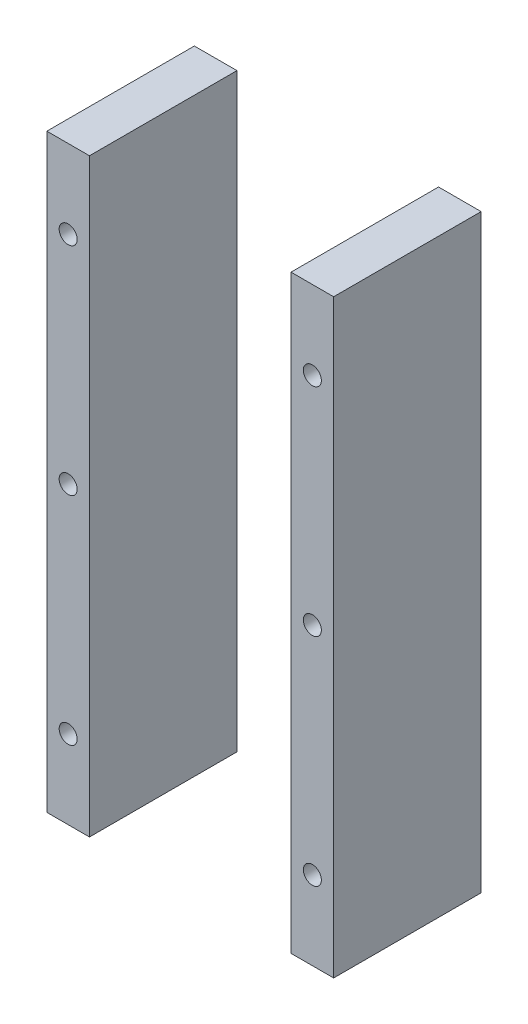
ISO-10303-21;
HEADER;
FILE_DESCRIPTION(('STEP AP214'),'2;1');
FILE_NAME('part.step','',(''),(''),'','','');
FILE_SCHEMA(('AUTOMOTIVE_DESIGN { 1 0 10303 214 1 1 1 1 }'));
ENDSEC;
DATA;
#1=APPLICATION_CONTEXT('core data for automotive mechanical design processes');
#2=APPLICATION_PROTOCOL_DEFINITION('international standard','automotive_design',2000,#1);
#3=PRODUCT_CONTEXT('',#1,'mechanical');
#4=PRODUCT('Part','Part','',(#3));
#5=PRODUCT_RELATED_PRODUCT_CATEGORY('part','',(#4));
#6=PRODUCT_DEFINITION_FORMATION('','',#4);
#7=PRODUCT_DEFINITION_CONTEXT('part definition',#1,'design');
#8=PRODUCT_DEFINITION('design','',#6,#7);
#9=PRODUCT_DEFINITION_SHAPE('','',#8);
#10=(LENGTH_UNIT() NAMED_UNIT(*) SI_UNIT(.MILLI.,.METRE.));
#11=(NAMED_UNIT(*) PLANE_ANGLE_UNIT() SI_UNIT($,.RADIAN.));
#12=(NAMED_UNIT(*) SI_UNIT($,.STERADIAN.) SOLID_ANGLE_UNIT());
#13=UNCERTAINTY_MEASURE_WITH_UNIT(LENGTH_MEASURE(1.E-05),#10,'distance_accuracy_value','');
#14=(GEOMETRIC_REPRESENTATION_CONTEXT(3) GLOBAL_UNCERTAINTY_ASSIGNED_CONTEXT((#13)) GLOBAL_UNIT_ASSIGNED_CONTEXT((#10,
#11,#12)) REPRESENTATION_CONTEXT('',''));
#15=CARTESIAN_POINT('',(0.,0.,0.));
#16=DIRECTION('',(0.,0.,1.));
#17=DIRECTION('',(1.,0.,0.));
#18=AXIS2_PLACEMENT_3D('',#15,#16,#17);
#19=CARTESIAN_POINT('',(136.,-180.,90.));
#20=DIRECTION('',(1.,0.,0.));
#21=DIRECTION('',(0.,0.,-1.));
#22=AXIS2_PLACEMENT_3D('',#19,#20,#21);
#23=PLANE('',#22);
#24=DIRECTION('',(0.,-1.,0.));
#25=VECTOR('',#24,1.);
#26=CARTESIAN_POINT('',(136.,-180.,0.));
#27=LINE('',#26,#25);
#28=CARTESIAN_POINT('',(136.,180.,0.));
#29=VERTEX_POINT('',#28);
#30=CARTESIAN_POINT('',(136.,-180.,0.));
#31=VERTEX_POINT('',#30);
#32=EDGE_CURVE('E106',#29,#31,#27,.T.);
#33=ORIENTED_EDGE('',*,*,#32,.T.);
#34=DIRECTION('',(0.,0.,-1.));
#35=VECTOR('',#34,1.);
#36=CARTESIAN_POINT('',(136.,-180.,90.));
#37=LINE('',#36,#35);
#38=CARTESIAN_POINT('',(136.,-180.,90.));
#39=VERTEX_POINT('',#38);
#40=EDGE_CURVE('E12',#39,#31,#37,.T.);
#41=ORIENTED_EDGE('',*,*,#40,.F.);
#42=DIRECTION('',(0.,-1.,0.));
#43=VECTOR('',#42,1.);
#44=CARTESIAN_POINT('',(136.,-180.,90.));
#45=LINE('',#44,#43);
#46=CARTESIAN_POINT('',(136.,180.,90.));
#47=VERTEX_POINT('',#46);
#48=EDGE_CURVE('E94',#47,#39,#45,.T.);
#49=ORIENTED_EDGE('',*,*,#48,.F.);
#50=DIRECTION('',(0.,0.,-1.));
#51=VECTOR('',#50,1.);
#52=CARTESIAN_POINT('',(136.,180.,90.));
#53=LINE('',#52,#51);
#54=EDGE_CURVE('E102',#47,#29,#53,.T.);
#55=ORIENTED_EDGE('',*,*,#54,.T.);
#56=EDGE_LOOP('',(#33,#41,#49,#55));
#57=FACE_BOUND('',#56,.T.);
#58=ADVANCED_FACE('F43',(#57),#23,.F.);
#59=CARTESIAN_POINT('',(162.,-180.,90.));
#60=DIRECTION('',(0.,1.,0.));
#61=DIRECTION('',(0.,0.,1.));
#62=AXIS2_PLACEMENT_3D('',#59,#60,#61);
#63=PLANE('',#62);
#64=DIRECTION('',(1.,0.,0.));
#65=VECTOR('',#64,1.);
#66=CARTESIAN_POINT('',(162.,-180.,0.));
#67=LINE('',#66,#65);
#68=CARTESIAN_POINT('',(162.,-180.,0.));
#69=VERTEX_POINT('',#68);
#70=EDGE_CURVE('E98',#31,#69,#67,.T.);
#71=ORIENTED_EDGE('',*,*,#70,.T.);
#72=DIRECTION('',(0.,0.,-1.));
#73=VECTOR('',#72,1.);
#74=CARTESIAN_POINT('',(162.,-180.,90.));
#75=LINE('',#74,#73);
#76=CARTESIAN_POINT('',(162.,-180.,90.));
#77=VERTEX_POINT('',#76);
#78=EDGE_CURVE('E51',#77,#69,#75,.T.);
#79=ORIENTED_EDGE('',*,*,#78,.F.);
#80=DIRECTION('',(1.,0.,0.));
#81=VECTOR('',#80,1.);
#82=CARTESIAN_POINT('',(162.,-180.,90.));
#83=LINE('',#82,#81);
#84=EDGE_CURVE('E89',#39,#77,#83,.T.);
#85=ORIENTED_EDGE('',*,*,#84,.F.);
#86=ORIENTED_EDGE('',*,*,#40,.T.);
#87=EDGE_LOOP('',(#71,#79,#85,#86));
#88=FACE_BOUND('',#87,.T.);
#89=ADVANCED_FACE('F97',(#88),#63,.F.);
#90=CARTESIAN_POINT('',(162.,180.,90.));
#91=DIRECTION('',(-1.,0.,0.));
#92=DIRECTION('',(0.,-1.,0.));
#93=AXIS2_PLACEMENT_3D('',#90,#91,#92);
#94=PLANE('',#93);
#95=DIRECTION('',(0.,1.,0.));
#96=VECTOR('',#95,1.);
#97=CARTESIAN_POINT('',(162.,180.,0.));
#98=LINE('',#97,#96);
#99=CARTESIAN_POINT('',(162.,180.,0.));
#100=VERTEX_POINT('',#99);
#101=EDGE_CURVE('E76',#69,#100,#98,.T.);
#102=ORIENTED_EDGE('',*,*,#101,.T.);
#103=DIRECTION('',(0.,0.,-1.));
#104=VECTOR('',#103,1.);
#105=CARTESIAN_POINT('',(162.,180.,90.));
#106=LINE('',#105,#104);
#107=CARTESIAN_POINT('',(162.,180.,90.));
#108=VERTEX_POINT('',#107);
#109=EDGE_CURVE('E99',#108,#100,#106,.T.);
#110=ORIENTED_EDGE('',*,*,#109,.F.);
#111=DIRECTION('',(0.,1.,0.));
#112=VECTOR('',#111,1.);
#113=CARTESIAN_POINT('',(162.,180.,90.));
#114=LINE('',#113,#112);
#115=EDGE_CURVE('E92',#77,#108,#114,.T.);
#116=ORIENTED_EDGE('',*,*,#115,.F.);
#117=ORIENTED_EDGE('',*,*,#78,.T.);
#118=EDGE_LOOP('',(#102,#110,#116,#117));
#119=FACE_BOUND('',#118,.T.);
#120=ADVANCED_FACE('F100',(#119),#94,.F.);
#121=CARTESIAN_POINT('',(136.,180.,90.));
#122=DIRECTION('',(0.,-1.,0.));
#123=DIRECTION('',(0.,0.,-1.));
#124=AXIS2_PLACEMENT_3D('',#121,#122,#123);
#125=PLANE('',#124);
#126=DIRECTION('',(-1.,0.,0.));
#127=VECTOR('',#126,1.);
#128=CARTESIAN_POINT('',(136.,180.,0.));
#129=LINE('',#128,#127);
#130=EDGE_CURVE('E82',#100,#29,#129,.T.);
#131=ORIENTED_EDGE('',*,*,#130,.T.);
#132=ORIENTED_EDGE('',*,*,#54,.F.);
#133=DIRECTION('',(-1.,0.,0.));
#134=VECTOR('',#133,1.);
#135=CARTESIAN_POINT('',(136.,180.,90.));
#136=LINE('',#135,#134);
#137=EDGE_CURVE('E59',#108,#47,#136,.T.);
#138=ORIENTED_EDGE('',*,*,#137,.F.);
#139=ORIENTED_EDGE('',*,*,#109,.T.);
#140=EDGE_LOOP('',(#131,#132,#138,#139));
#141=FACE_BOUND('',#140,.T.);
#142=ADVANCED_FACE('F114',(#141),#125,.F.);
#143=CARTESIAN_POINT('',(0.,0.,90.));
#144=DIRECTION('',(0.,0.,-1.));
#145=DIRECTION('',(-1.,0.,0.));
#146=AXIS2_PLACEMENT_3D('',#143,#144,#145);
#147=PLANE('',#146);
#148=CARTESIAN_POINT('',(149.,-132.,90.));
#149=DIRECTION('',(0.,0.,1.));
#150=DIRECTION('',(1.,0.,0.));
#151=AXIS2_PLACEMENT_3D('',#148,#149,#150);
#152=CIRCLE('',#151,5.49999999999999);
#153=CARTESIAN_POINT('',(154.5,-132.,90.));
#154=VERTEX_POINT('',#153);
#155=EDGE_CURVE('E132',#154,#154,#152,.T.);
#156=ORIENTED_EDGE('',*,*,#155,.F.);
#157=EDGE_LOOP('',(#156));
#158=FACE_BOUND('',#157,.T.);
#159=CARTESIAN_POINT('',(149.,1.11022302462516E-13,90.));
#160=DIRECTION('',(0.,0.,1.));
#161=DIRECTION('',(-1.,0.,0.));
#162=AXIS2_PLACEMENT_3D('',#159,#160,#161);
#163=CIRCLE('',#162,5.50000000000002);
#164=CARTESIAN_POINT('',(154.5,1.11022302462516E-13,90.));
#165=VERTEX_POINT('',#164);
#166=EDGE_CURVE('E126',#165,#165,#163,.T.);
#167=ORIENTED_EDGE('',*,*,#166,.F.);
#168=EDGE_LOOP('',(#167));
#169=FACE_BOUND('',#168,.T.);
#170=CARTESIAN_POINT('',(149.,132.,90.));
#171=DIRECTION('',(0.,0.,1.));
#172=DIRECTION('',(-1.,0.,0.));
#173=AXIS2_PLACEMENT_3D('',#170,#171,#172);
#174=CIRCLE('',#173,5.49999999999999);
#175=CARTESIAN_POINT('',(154.5,132.,90.));
#176=VERTEX_POINT('',#175);
#177=EDGE_CURVE('E120',#176,#176,#174,.T.);
#178=ORIENTED_EDGE('',*,*,#177,.F.);
#179=EDGE_LOOP('',(#178));
#180=FACE_BOUND('',#179,.T.);
#181=ORIENTED_EDGE('',*,*,#48,.T.);
#182=ORIENTED_EDGE('',*,*,#84,.T.);
#183=ORIENTED_EDGE('',*,*,#115,.T.);
#184=ORIENTED_EDGE('',*,*,#137,.T.);
#185=EDGE_LOOP('',(#181,#182,#183,#184));
#186=FACE_BOUND('',#185,.T.);
#187=ADVANCED_FACE('F90',(#158,#169,#180,#186),#147,.F.);
#188=CARTESIAN_POINT('',(0.,0.,0.));
#189=DIRECTION('',(0.,0.,-1.));
#190=DIRECTION('',(-1.,0.,0.));
#191=AXIS2_PLACEMENT_3D('',#188,#189,#190);
#192=PLANE('',#191);
#193=CARTESIAN_POINT('',(149.,-132.,0.));
#194=DIRECTION('',(0.,0.,1.));
#195=DIRECTION('',(1.,0.,0.));
#196=AXIS2_PLACEMENT_3D('',#193,#194,#195);
#197=CIRCLE('',#196,5.49999999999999);
#198=CARTESIAN_POINT('',(154.5,-132.,0.));
#199=VERTEX_POINT('',#198);
#200=EDGE_CURVE('E109',#199,#199,#197,.T.);
#201=ORIENTED_EDGE('',*,*,#200,.T.);
#202=EDGE_LOOP('',(#201));
#203=FACE_BOUND('',#202,.T.);
#204=CARTESIAN_POINT('',(149.,1.11022302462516E-13,0.));
#205=DIRECTION('',(0.,0.,1.));
#206=DIRECTION('',(-1.,0.,0.));
#207=AXIS2_PLACEMENT_3D('',#204,#205,#206);
#208=CIRCLE('',#207,5.50000000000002);
#209=CARTESIAN_POINT('',(154.5,1.11022302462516E-13,0.));
#210=VERTEX_POINT('',#209);
#211=EDGE_CURVE('E129',#210,#210,#208,.T.);
#212=ORIENTED_EDGE('',*,*,#211,.T.);
#213=EDGE_LOOP('',(#212));
#214=FACE_BOUND('',#213,.T.);
#215=CARTESIAN_POINT('',(149.,132.,0.));
#216=DIRECTION('',(0.,0.,1.));
#217=DIRECTION('',(-1.,0.,0.));
#218=AXIS2_PLACEMENT_3D('',#215,#216,#217);
#219=CIRCLE('',#218,5.49999999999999);
#220=CARTESIAN_POINT('',(154.5,132.,0.));
#221=VERTEX_POINT('',#220);
#222=EDGE_CURVE('E123',#221,#221,#219,.T.);
#223=ORIENTED_EDGE('',*,*,#222,.T.);
#224=EDGE_LOOP('',(#223));
#225=FACE_BOUND('',#224,.T.);
#226=ORIENTED_EDGE('',*,*,#32,.F.);
#227=ORIENTED_EDGE('',*,*,#130,.F.);
#228=ORIENTED_EDGE('',*,*,#101,.F.);
#229=ORIENTED_EDGE('',*,*,#70,.F.);
#230=EDGE_LOOP('',(#226,#227,#228,#229));
#231=FACE_BOUND('',#230,.T.);
#232=ADVANCED_FACE('F117',(#203,#214,#225,#231),#192,.T.);
#233=CARTESIAN_POINT('',(149.,132.,0.));
#234=DIRECTION('',(0.,0.,1.));
#235=DIRECTION('',(1.,0.,0.));
#236=AXIS2_PLACEMENT_3D('',#233,#234,#235);
#237=CYLINDRICAL_SURFACE('',#236,5.49999999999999);
#238=CARTESIAN_POINT('',(154.5,132.,0.));
#239=CARTESIAN_POINT('',(154.5,132.,0.937499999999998));
#240=CARTESIAN_POINT('',(154.5,132.,1.875));
#241=CARTESIAN_POINT('',(154.5,132.,3.75));
#242=CARTESIAN_POINT('',(154.5,132.,4.6875));
#243=CARTESIAN_POINT('',(154.5,132.,6.5625));
#244=CARTESIAN_POINT('',(154.5,132.,7.5));
#245=CARTESIAN_POINT('',(154.5,132.,9.375));
#246=CARTESIAN_POINT('',(154.5,132.,10.3125));
#247=CARTESIAN_POINT('',(154.5,132.,12.1875));
#248=CARTESIAN_POINT('',(154.5,132.,13.125));
#249=CARTESIAN_POINT('',(154.5,132.,15.));
#250=CARTESIAN_POINT('',(154.5,132.,15.9375));
#251=CARTESIAN_POINT('',(154.5,132.,17.8125));
#252=CARTESIAN_POINT('',(154.5,132.,18.75));
#253=CARTESIAN_POINT('',(154.5,132.,20.625));
#254=CARTESIAN_POINT('',(154.5,132.,21.5625));
#255=CARTESIAN_POINT('',(154.5,132.,23.4375));
#256=CARTESIAN_POINT('',(154.5,132.,24.375));
#257=CARTESIAN_POINT('',(154.5,132.,26.25));
#258=CARTESIAN_POINT('',(154.5,132.,27.1875));
#259=CARTESIAN_POINT('',(154.5,132.,29.0625));
#260=CARTESIAN_POINT('',(154.5,132.,30.));
#261=CARTESIAN_POINT('',(154.5,132.,31.875));
#262=CARTESIAN_POINT('',(154.5,132.,32.8125));
#263=CARTESIAN_POINT('',(154.5,132.,34.6875));
#264=CARTESIAN_POINT('',(154.5,132.,35.625));
#265=CARTESIAN_POINT('',(154.5,132.,37.5));
#266=CARTESIAN_POINT('',(154.5,132.,38.4375));
#267=CARTESIAN_POINT('',(154.5,132.,40.3125));
#268=CARTESIAN_POINT('',(154.5,132.,41.25));
#269=CARTESIAN_POINT('',(154.5,132.,43.125));
#270=CARTESIAN_POINT('',(154.5,132.,44.0625));
#271=CARTESIAN_POINT('',(154.5,132.,45.9375));
#272=CARTESIAN_POINT('',(154.5,132.,46.875));
#273=CARTESIAN_POINT('',(154.5,132.,48.75));
#274=CARTESIAN_POINT('',(154.5,132.,49.6875));
#275=CARTESIAN_POINT('',(154.5,132.,51.5625));
#276=CARTESIAN_POINT('',(154.5,132.,52.5));
#277=CARTESIAN_POINT('',(154.5,132.,54.375));
#278=CARTESIAN_POINT('',(154.5,132.,55.3125));
#279=CARTESIAN_POINT('',(154.5,132.,57.1875));
#280=CARTESIAN_POINT('',(154.5,132.,58.125));
#281=CARTESIAN_POINT('',(154.5,132.,60.));
#282=CARTESIAN_POINT('',(154.5,132.,60.9375));
#283=CARTESIAN_POINT('',(154.5,132.,62.8125));
#284=CARTESIAN_POINT('',(154.5,132.,63.75));
#285=CARTESIAN_POINT('',(154.5,132.,65.625));
#286=CARTESIAN_POINT('',(154.5,132.,66.5625));
#287=CARTESIAN_POINT('',(154.5,132.,68.4375));
#288=CARTESIAN_POINT('',(154.5,132.,69.375));
#289=CARTESIAN_POINT('',(154.5,132.,71.25));
#290=CARTESIAN_POINT('',(154.5,132.,72.1875));
#291=CARTESIAN_POINT('',(154.5,132.,74.0625));
#292=CARTESIAN_POINT('',(154.5,132.,75.));
#293=CARTESIAN_POINT('',(154.5,132.,76.875));
#294=CARTESIAN_POINT('',(154.5,132.,77.8125));
#295=CARTESIAN_POINT('',(154.5,132.,79.6875));
#296=CARTESIAN_POINT('',(154.5,132.,80.625));
#297=CARTESIAN_POINT('',(154.5,132.,82.5));
#298=CARTESIAN_POINT('',(154.5,132.,83.4375));
#299=CARTESIAN_POINT('',(154.5,132.,85.3125));
#300=CARTESIAN_POINT('',(154.5,132.,86.25));
#301=CARTESIAN_POINT('',(154.5,132.,88.125));
#302=CARTESIAN_POINT('',(154.5,132.,89.0625));
#303=CARTESIAN_POINT('',(154.5,132.,90.));
#304=B_SPLINE_CURVE_WITH_KNOTS('',3,(#238,#239,#240,#241,#242,#243,#244,#245,#246,#247,#248,
#249,#250,#251,#252,#253,#254,#255,#256,#257,#258,#259,#260,#261,#262,#263,#264,#265,#266,#267,
#268,#269,#270,#271,#272,#273,#274,#275,#276,#277,#278,#279,#280,#281,#282,#283,#284,#285,#286,
#287,#288,#289,#290,#291,#292,#293,#294,#295,#296,#297,#298,#299,#300,#301,#302,#303),
.UNSPECIFIED.,.F.,.F.,(4,2,2,2,2,2,2,2,2,2,2,2,2,2,2,2,2,2,2,2,2,2,2,2,2,2,2,2,2,2,2,2,4),(0.,
2.8125,5.625,8.4375,11.25,14.0625,16.875,19.6875,22.5,25.3125,28.125,30.9375,33.75,36.5625,
39.375,42.1875,45.,47.8125,50.625,53.4375,56.25,59.0625,61.875,64.6875,67.5,70.3125,73.125,
75.9375,78.75,81.5625,84.375,87.1875,90.),.UNSPECIFIED.);
#305=EDGE_CURVE('BSEAM154',#221,#176,#304,.T.);
#306=ORIENTED_EDGE('',*,*,#222,.F.);
#307=ORIENTED_EDGE('',*,*,#177,.T.);
#308=ORIENTED_EDGE('',*,*,#305,.T.);
#309=ORIENTED_EDGE('',*,*,#305,.F.);
#310=EDGE_LOOP('',(#306,#308,#307,#309));
#311=FACE_BOUND('',#310,.T.);
#312=ADVANCED_FACE('F154',(#311),#237,.F.);
#313=CARTESIAN_POINT('',(149.,1.11022302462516E-13,0.));
#314=DIRECTION('',(0.,0.,1.));
#315=DIRECTION('',(1.,0.,0.));
#316=AXIS2_PLACEMENT_3D('',#313,#314,#315);
#317=CYLINDRICAL_SURFACE('',#316,5.50000000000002);
#318=CARTESIAN_POINT('',(154.5,1.11022302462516E-13,0.));
#319=CARTESIAN_POINT('',(154.5,1.11022302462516E-13,0.937499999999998));
#320=CARTESIAN_POINT('',(154.5,1.11022302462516E-13,1.875));
#321=CARTESIAN_POINT('',(154.5,1.11022302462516E-13,3.75));
#322=CARTESIAN_POINT('',(154.5,1.11022302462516E-13,4.6875));
#323=CARTESIAN_POINT('',(154.5,1.11022302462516E-13,6.5625));
#324=CARTESIAN_POINT('',(154.5,1.11022302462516E-13,7.5));
#325=CARTESIAN_POINT('',(154.5,1.11022302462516E-13,9.375));
#326=CARTESIAN_POINT('',(154.5,1.11022302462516E-13,10.3125));
#327=CARTESIAN_POINT('',(154.5,1.11022302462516E-13,12.1875));
#328=CARTESIAN_POINT('',(154.5,1.11022302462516E-13,13.125));
#329=CARTESIAN_POINT('',(154.5,1.11022302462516E-13,15.));
#330=CARTESIAN_POINT('',(154.5,1.11022302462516E-13,15.9375));
#331=CARTESIAN_POINT('',(154.5,1.11022302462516E-13,17.8125));
#332=CARTESIAN_POINT('',(154.5,1.11022302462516E-13,18.75));
#333=CARTESIAN_POINT('',(154.5,1.11022302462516E-13,20.625));
#334=CARTESIAN_POINT('',(154.5,1.11022302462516E-13,21.5625));
#335=CARTESIAN_POINT('',(154.5,1.11022302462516E-13,23.4375));
#336=CARTESIAN_POINT('',(154.5,1.11022302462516E-13,24.375));
#337=CARTESIAN_POINT('',(154.5,1.11022302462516E-13,26.25));
#338=CARTESIAN_POINT('',(154.5,1.11022302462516E-13,27.1875));
#339=CARTESIAN_POINT('',(154.5,1.11022302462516E-13,29.0625));
#340=CARTESIAN_POINT('',(154.5,1.11022302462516E-13,30.));
#341=CARTESIAN_POINT('',(154.5,1.11022302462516E-13,31.875));
#342=CARTESIAN_POINT('',(154.5,1.11022302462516E-13,32.8125));
#343=CARTESIAN_POINT('',(154.5,1.11022302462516E-13,34.6875));
#344=CARTESIAN_POINT('',(154.5,1.11022302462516E-13,35.625));
#345=CARTESIAN_POINT('',(154.5,1.11022302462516E-13,37.5));
#346=CARTESIAN_POINT('',(154.5,1.11022302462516E-13,38.4375));
#347=CARTESIAN_POINT('',(154.5,1.11022302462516E-13,40.3125));
#348=CARTESIAN_POINT('',(154.5,1.11022302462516E-13,41.25));
#349=CARTESIAN_POINT('',(154.5,1.11022302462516E-13,43.125));
#350=CARTESIAN_POINT('',(154.5,1.11022302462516E-13,44.0625));
#351=CARTESIAN_POINT('',(154.5,1.11022302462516E-13,45.9375));
#352=CARTESIAN_POINT('',(154.5,1.11022302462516E-13,46.875));
#353=CARTESIAN_POINT('',(154.5,1.11022302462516E-13,48.75));
#354=CARTESIAN_POINT('',(154.5,1.11022302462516E-13,49.6875));
#355=CARTESIAN_POINT('',(154.5,1.11022302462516E-13,51.5625));
#356=CARTESIAN_POINT('',(154.5,1.11022302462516E-13,52.5));
#357=CARTESIAN_POINT('',(154.5,1.11022302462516E-13,54.375));
#358=CARTESIAN_POINT('',(154.5,1.11022302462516E-13,55.3125));
#359=CARTESIAN_POINT('',(154.5,1.11022302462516E-13,57.1875));
#360=CARTESIAN_POINT('',(154.5,1.11022302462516E-13,58.125));
#361=CARTESIAN_POINT('',(154.5,1.11022302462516E-13,60.));
#362=CARTESIAN_POINT('',(154.5,1.11022302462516E-13,60.9375));
#363=CARTESIAN_POINT('',(154.5,1.11022302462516E-13,62.8125));
#364=CARTESIAN_POINT('',(154.5,1.11022302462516E-13,63.75));
#365=CARTESIAN_POINT('',(154.5,1.11022302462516E-13,65.625));
#366=CARTESIAN_POINT('',(154.5,1.11022302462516E-13,66.5625));
#367=CARTESIAN_POINT('',(154.5,1.11022302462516E-13,68.4375));
#368=CARTESIAN_POINT('',(154.5,1.11022302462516E-13,69.375));
#369=CARTESIAN_POINT('',(154.5,1.11022302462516E-13,71.25));
#370=CARTESIAN_POINT('',(154.5,1.11022302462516E-13,72.1875));
#371=CARTESIAN_POINT('',(154.5,1.11022302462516E-13,74.0625));
#372=CARTESIAN_POINT('',(154.5,1.11022302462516E-13,75.));
#373=CARTESIAN_POINT('',(154.5,1.11022302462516E-13,76.875));
#374=CARTESIAN_POINT('',(154.5,1.11022302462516E-13,77.8125));
#375=CARTESIAN_POINT('',(154.5,1.11022302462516E-13,79.6875));
#376=CARTESIAN_POINT('',(154.5,1.11022302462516E-13,80.625));
#377=CARTESIAN_POINT('',(154.5,1.11022302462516E-13,82.5));
#378=CARTESIAN_POINT('',(154.5,1.11022302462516E-13,83.4375));
#379=CARTESIAN_POINT('',(154.5,1.11022302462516E-13,85.3125));
#380=CARTESIAN_POINT('',(154.5,1.11022302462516E-13,86.25));
#381=CARTESIAN_POINT('',(154.5,1.11022302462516E-13,88.125));
#382=CARTESIAN_POINT('',(154.5,1.11022302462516E-13,89.0625));
#383=CARTESIAN_POINT('',(154.5,1.11022302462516E-13,90.));
#384=B_SPLINE_CURVE_WITH_KNOTS('',3,(#318,#319,#320,#321,#322,#323,#324,#325,#326,#327,#328,
#329,#330,#331,#332,#333,#334,#335,#336,#337,#338,#339,#340,#341,#342,#343,#344,#345,#346,#347,
#348,#349,#350,#351,#352,#353,#354,#355,#356,#357,#358,#359,#360,#361,#362,#363,#364,#365,#366,
#367,#368,#369,#370,#371,#372,#373,#374,#375,#376,#377,#378,#379,#380,#381,#382,#383),
.UNSPECIFIED.,.F.,.F.,(4,2,2,2,2,2,2,2,2,2,2,2,2,2,2,2,2,2,2,2,2,2,2,2,2,2,2,2,2,2,2,2,4),(0.,
2.8125,5.625,8.4375,11.25,14.0625,16.875,19.6875,22.5,25.3125,28.125,30.9375,33.75,36.5625,
39.375,42.1875,45.,47.8125,50.625,53.4375,56.25,59.0625,61.875,64.6875,67.5,70.3125,73.125,
75.9375,78.75,81.5625,84.375,87.1875,90.),.UNSPECIFIED.);
#385=EDGE_CURVE('BSEAM143',#210,#165,#384,.T.);
#386=ORIENTED_EDGE('',*,*,#211,.F.);
#387=ORIENTED_EDGE('',*,*,#166,.T.);
#388=ORIENTED_EDGE('',*,*,#385,.T.);
#389=ORIENTED_EDGE('',*,*,#385,.F.);
#390=EDGE_LOOP('',(#386,#388,#387,#389));
#391=FACE_BOUND('',#390,.T.);
#392=ADVANCED_FACE('F143',(#391),#317,.F.);
#393=CARTESIAN_POINT('',(149.,-132.,0.));
#394=DIRECTION('',(0.,0.,1.));
#395=DIRECTION('',(1.,0.,0.));
#396=AXIS2_PLACEMENT_3D('',#393,#394,#395);
#397=CYLINDRICAL_SURFACE('',#396,5.49999999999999);
#398=CARTESIAN_POINT('',(154.5,-132.,0.));
#399=CARTESIAN_POINT('',(154.5,-132.,0.937499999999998));
#400=CARTESIAN_POINT('',(154.5,-132.,1.875));
#401=CARTESIAN_POINT('',(154.5,-132.,3.75));
#402=CARTESIAN_POINT('',(154.5,-132.,4.6875));
#403=CARTESIAN_POINT('',(154.5,-132.,6.5625));
#404=CARTESIAN_POINT('',(154.5,-132.,7.5));
#405=CARTESIAN_POINT('',(154.5,-132.,9.375));
#406=CARTESIAN_POINT('',(154.5,-132.,10.3125));
#407=CARTESIAN_POINT('',(154.5,-132.,12.1875));
#408=CARTESIAN_POINT('',(154.5,-132.,13.125));
#409=CARTESIAN_POINT('',(154.5,-132.,15.));
#410=CARTESIAN_POINT('',(154.5,-132.,15.9375));
#411=CARTESIAN_POINT('',(154.5,-132.,17.8125));
#412=CARTESIAN_POINT('',(154.5,-132.,18.75));
#413=CARTESIAN_POINT('',(154.5,-132.,20.625));
#414=CARTESIAN_POINT('',(154.5,-132.,21.5625));
#415=CARTESIAN_POINT('',(154.5,-132.,23.4375));
#416=CARTESIAN_POINT('',(154.5,-132.,24.375));
#417=CARTESIAN_POINT('',(154.5,-132.,26.25));
#418=CARTESIAN_POINT('',(154.5,-132.,27.1875));
#419=CARTESIAN_POINT('',(154.5,-132.,29.0625));
#420=CARTESIAN_POINT('',(154.5,-132.,30.));
#421=CARTESIAN_POINT('',(154.5,-132.,31.875));
#422=CARTESIAN_POINT('',(154.5,-132.,32.8125));
#423=CARTESIAN_POINT('',(154.5,-132.,34.6875));
#424=CARTESIAN_POINT('',(154.5,-132.,35.625));
#425=CARTESIAN_POINT('',(154.5,-132.,37.5));
#426=CARTESIAN_POINT('',(154.5,-132.,38.4375));
#427=CARTESIAN_POINT('',(154.5,-132.,40.3125));
#428=CARTESIAN_POINT('',(154.5,-132.,41.25));
#429=CARTESIAN_POINT('',(154.5,-132.,43.125));
#430=CARTESIAN_POINT('',(154.5,-132.,44.0625));
#431=CARTESIAN_POINT('',(154.5,-132.,45.9375));
#432=CARTESIAN_POINT('',(154.5,-132.,46.875));
#433=CARTESIAN_POINT('',(154.5,-132.,48.75));
#434=CARTESIAN_POINT('',(154.5,-132.,49.6875));
#435=CARTESIAN_POINT('',(154.5,-132.,51.5625));
#436=CARTESIAN_POINT('',(154.5,-132.,52.5));
#437=CARTESIAN_POINT('',(154.5,-132.,54.375));
#438=CARTESIAN_POINT('',(154.5,-132.,55.3125));
#439=CARTESIAN_POINT('',(154.5,-132.,57.1875));
#440=CARTESIAN_POINT('',(154.5,-132.,58.125));
#441=CARTESIAN_POINT('',(154.5,-132.,60.));
#442=CARTESIAN_POINT('',(154.5,-132.,60.9375));
#443=CARTESIAN_POINT('',(154.5,-132.,62.8125));
#444=CARTESIAN_POINT('',(154.5,-132.,63.75));
#445=CARTESIAN_POINT('',(154.5,-132.,65.625));
#446=CARTESIAN_POINT('',(154.5,-132.,66.5625));
#447=CARTESIAN_POINT('',(154.5,-132.,68.4375));
#448=CARTESIAN_POINT('',(154.5,-132.,69.375));
#449=CARTESIAN_POINT('',(154.5,-132.,71.25));
#450=CARTESIAN_POINT('',(154.5,-132.,72.1875));
#451=CARTESIAN_POINT('',(154.5,-132.,74.0625));
#452=CARTESIAN_POINT('',(154.5,-132.,75.));
#453=CARTESIAN_POINT('',(154.5,-132.,76.875));
#454=CARTESIAN_POINT('',(154.5,-132.,77.8125));
#455=CARTESIAN_POINT('',(154.5,-132.,79.6875));
#456=CARTESIAN_POINT('',(154.5,-132.,80.625));
#457=CARTESIAN_POINT('',(154.5,-132.,82.5));
#458=CARTESIAN_POINT('',(154.5,-132.,83.4375));
#459=CARTESIAN_POINT('',(154.5,-132.,85.3125));
#460=CARTESIAN_POINT('',(154.5,-132.,86.25));
#461=CARTESIAN_POINT('',(154.5,-132.,88.125));
#462=CARTESIAN_POINT('',(154.5,-132.,89.0625));
#463=CARTESIAN_POINT('',(154.5,-132.,90.));
#464=B_SPLINE_CURVE_WITH_KNOTS('',3,(#398,#399,#400,#401,#402,#403,#404,#405,#406,#407,#408,
#409,#410,#411,#412,#413,#414,#415,#416,#417,#418,#419,#420,#421,#422,#423,#424,#425,#426,#427,
#428,#429,#430,#431,#432,#433,#434,#435,#436,#437,#438,#439,#440,#441,#442,#443,#444,#445,#446,
#447,#448,#449,#450,#451,#452,#453,#454,#455,#456,#457,#458,#459,#460,#461,#462,#463),
.UNSPECIFIED.,.F.,.F.,(4,2,2,2,2,2,2,2,2,2,2,2,2,2,2,2,2,2,2,2,2,2,2,2,2,2,2,2,2,2,2,2,4),(0.,
2.8125,5.625,8.4375,11.25,14.0625,16.875,19.6875,22.5,25.3125,28.125,30.9375,33.75,36.5625,
39.375,42.1875,45.,47.8125,50.625,53.4375,56.25,59.0625,61.875,64.6875,67.5,70.3125,73.125,
75.9375,78.75,81.5625,84.375,87.1875,90.),.UNSPECIFIED.);
#465=EDGE_CURVE('BSEAM140',#199,#154,#464,.T.);
#466=ORIENTED_EDGE('',*,*,#200,.F.);
#467=ORIENTED_EDGE('',*,*,#155,.T.);
#468=ORIENTED_EDGE('',*,*,#465,.T.);
#469=ORIENTED_EDGE('',*,*,#465,.F.);
#470=EDGE_LOOP('',(#466,#468,#467,#469));
#471=FACE_BOUND('',#470,.T.);
#472=ADVANCED_FACE('F140',(#471),#397,.F.);
#473=CLOSED_SHELL('',(#58,#89,#120,#142,#187,#232,#312,#392,#472));
#474=MANIFOLD_SOLID_BREP('B2',#473);
#475=CARTESIAN_POINT('',(-13.,-180.,90.));
#476=DIRECTION('',(1.,0.,0.));
#477=DIRECTION('',(0.,0.,-1.));
#478=AXIS2_PLACEMENT_3D('',#475,#476,#477);
#479=PLANE('',#478);
#480=DIRECTION('',(0.,-1.,0.));
#481=VECTOR('',#480,1.);
#482=CARTESIAN_POINT('',(-13.,-180.,0.));
#483=LINE('',#482,#481);
#484=CARTESIAN_POINT('',(-13.,180.,0.));
#485=VERTEX_POINT('',#484);
#486=CARTESIAN_POINT('',(-13.,-180.,0.));
#487=VERTEX_POINT('',#486);
#488=EDGE_CURVE('E293',#485,#487,#483,.T.);
#489=ORIENTED_EDGE('',*,*,#488,.T.);
#490=DIRECTION('',(0.,0.,-1.));
#491=VECTOR('',#490,1.);
#492=CARTESIAN_POINT('',(-13.,-180.,90.));
#493=LINE('',#492,#491);
#494=CARTESIAN_POINT('',(-13.,-180.,90.));
#495=VERTEX_POINT('',#494);
#496=EDGE_CURVE('E41',#495,#487,#493,.T.);
#497=ORIENTED_EDGE('',*,*,#496,.F.);
#498=DIRECTION('',(0.,-1.,0.));
#499=VECTOR('',#498,1.);
#500=CARTESIAN_POINT('',(-13.,-180.,90.));
#501=LINE('',#500,#499);
#502=CARTESIAN_POINT('',(-13.,180.,90.));
#503=VERTEX_POINT('',#502);
#504=EDGE_CURVE('E281',#503,#495,#501,.T.);
#505=ORIENTED_EDGE('',*,*,#504,.F.);
#506=DIRECTION('',(0.,0.,-1.));
#507=VECTOR('',#506,1.);
#508=CARTESIAN_POINT('',(-13.,180.,90.));
#509=LINE('',#508,#507);
#510=EDGE_CURVE('E289',#503,#485,#509,.T.);
#511=ORIENTED_EDGE('',*,*,#510,.T.);
#512=EDGE_LOOP('',(#489,#497,#505,#511));
#513=FACE_BOUND('',#512,.T.);
#514=ADVANCED_FACE('F230',(#513),#479,.F.);
#515=CARTESIAN_POINT('',(13.,-180.,90.));
#516=DIRECTION('',(0.,1.,0.));
#517=DIRECTION('',(0.,0.,1.));
#518=AXIS2_PLACEMENT_3D('',#515,#516,#517);
#519=PLANE('',#518);
#520=DIRECTION('',(1.,0.,0.));
#521=VECTOR('',#520,1.);
#522=CARTESIAN_POINT('',(13.,-180.,0.));
#523=LINE('',#522,#521);
#524=CARTESIAN_POINT('',(13.,-180.,0.));
#525=VERTEX_POINT('',#524);
#526=EDGE_CURVE('E285',#487,#525,#523,.T.);
#527=ORIENTED_EDGE('',*,*,#526,.T.);
#528=DIRECTION('',(0.,0.,-1.));
#529=VECTOR('',#528,1.);
#530=CARTESIAN_POINT('',(13.,-180.,90.));
#531=LINE('',#530,#529);
#532=CARTESIAN_POINT('',(13.,-180.,90.));
#533=VERTEX_POINT('',#532);
#534=EDGE_CURVE('E238',#533,#525,#531,.T.);
#535=ORIENTED_EDGE('',*,*,#534,.F.);
#536=DIRECTION('',(1.,0.,0.));
#537=VECTOR('',#536,1.);
#538=CARTESIAN_POINT('',(13.,-180.,90.));
#539=LINE('',#538,#537);
#540=EDGE_CURVE('E276',#495,#533,#539,.T.);
#541=ORIENTED_EDGE('',*,*,#540,.F.);
#542=ORIENTED_EDGE('',*,*,#496,.T.);
#543=EDGE_LOOP('',(#527,#535,#541,#542));
#544=FACE_BOUND('',#543,.T.);
#545=ADVANCED_FACE('F284',(#544),#519,.F.);
#546=CARTESIAN_POINT('',(13.,-180.,90.));
#547=DIRECTION('',(-1.,0.,0.));
#548=DIRECTION('',(0.,0.,1.));
#549=AXIS2_PLACEMENT_3D('',#546,#547,#548);
#550=PLANE('',#549);
#551=DIRECTION('',(0.,1.,0.));
#552=VECTOR('',#551,1.);
#553=CARTESIAN_POINT('',(13.,-180.,0.));
#554=LINE('',#553,#552);
#555=CARTESIAN_POINT('',(13.,180.,0.));
#556=VERTEX_POINT('',#555);
#557=EDGE_CURVE('E263',#525,#556,#554,.T.);
#558=ORIENTED_EDGE('',*,*,#557,.T.);
#559=DIRECTION('',(0.,0.,-1.));
#560=VECTOR('',#559,1.);
#561=CARTESIAN_POINT('',(13.,180.,90.));
#562=LINE('',#561,#560);
#563=CARTESIAN_POINT('',(13.,180.,90.));
#564=VERTEX_POINT('',#563);
#565=EDGE_CURVE('E286',#564,#556,#562,.T.);
#566=ORIENTED_EDGE('',*,*,#565,.F.);
#567=DIRECTION('',(0.,1.,0.));
#568=VECTOR('',#567,1.);
#569=CARTESIAN_POINT('',(13.,-180.,90.));
#570=LINE('',#569,#568);
#571=EDGE_CURVE('E279',#533,#564,#570,.T.);
#572=ORIENTED_EDGE('',*,*,#571,.F.);
#573=ORIENTED_EDGE('',*,*,#534,.T.);
#574=EDGE_LOOP('',(#558,#566,#572,#573));
#575=FACE_BOUND('',#574,.T.);
#576=ADVANCED_FACE('F287',(#575),#550,.F.);
#577=CARTESIAN_POINT('',(13.,180.,90.));
#578=DIRECTION('',(0.,-1.,0.));
#579=DIRECTION('',(0.,0.,-1.));
#580=AXIS2_PLACEMENT_3D('',#577,#578,#579);
#581=PLANE('',#580);
#582=DIRECTION('',(-1.,0.,0.));
#583=VECTOR('',#582,1.);
#584=CARTESIAN_POINT('',(13.,180.,0.));
#585=LINE('',#584,#583);
#586=EDGE_CURVE('E269',#556,#485,#585,.T.);
#587=ORIENTED_EDGE('',*,*,#586,.T.);
#588=ORIENTED_EDGE('',*,*,#510,.F.);
#589=DIRECTION('',(-1.,0.,0.));
#590=VECTOR('',#589,1.);
#591=CARTESIAN_POINT('',(13.,180.,90.));
#592=LINE('',#591,#590);
#593=EDGE_CURVE('E246',#564,#503,#592,.T.);
#594=ORIENTED_EDGE('',*,*,#593,.F.);
#595=ORIENTED_EDGE('',*,*,#565,.T.);
#596=EDGE_LOOP('',(#587,#588,#594,#595));
#597=FACE_BOUND('',#596,.T.);
#598=ADVANCED_FACE('F301',(#597),#581,.F.);
#599=CARTESIAN_POINT('',(0.,0.,90.));
#600=DIRECTION('',(0.,0.,1.));
#601=DIRECTION('',(1.,0.,0.));
#602=AXIS2_PLACEMENT_3D('',#599,#600,#601);
#603=PLANE('',#602);
#604=CARTESIAN_POINT('',(0.,132.,90.));
#605=DIRECTION('',(0.,0.,1.));
#606=DIRECTION('',(1.,0.,0.));
#607=AXIS2_PLACEMENT_3D('',#604,#605,#606);
#608=CIRCLE('',#607,5.5);
#609=CARTESIAN_POINT('',(5.50000000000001,132.,90.));
#610=VERTEX_POINT('',#609);
#611=EDGE_CURVE('E319',#610,#610,#608,.T.);
#612=ORIENTED_EDGE('',*,*,#611,.F.);
#613=EDGE_LOOP('',(#612));
#614=FACE_BOUND('',#613,.T.);
#615=CARTESIAN_POINT('',(0.,0.,90.));
#616=DIRECTION('',(0.,0.,1.));
#617=DIRECTION('',(1.,0.,0.));
#618=AXIS2_PLACEMENT_3D('',#615,#616,#617);
#619=CIRCLE('',#618,5.5);
#620=CARTESIAN_POINT('',(5.5,0.,90.));
#621=VERTEX_POINT('',#620);
#622=EDGE_CURVE('E313',#621,#621,#619,.T.);
#623=ORIENTED_EDGE('',*,*,#622,.F.);
#624=EDGE_LOOP('',(#623));
#625=FACE_BOUND('',#624,.T.);
#626=CARTESIAN_POINT('',(0.,-132.,90.));
#627=DIRECTION('',(0.,0.,1.));
#628=DIRECTION('',(-1.,0.,0.));
#629=AXIS2_PLACEMENT_3D('',#626,#627,#628);
#630=CIRCLE('',#629,5.5);
#631=CARTESIAN_POINT('',(5.50000000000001,-132.,90.));
#632=VERTEX_POINT('',#631);
#633=EDGE_CURVE('E307',#632,#632,#630,.T.);
#634=ORIENTED_EDGE('',*,*,#633,.F.);
#635=EDGE_LOOP('',(#634));
#636=FACE_BOUND('',#635,.T.);
#637=ORIENTED_EDGE('',*,*,#504,.T.);
#638=ORIENTED_EDGE('',*,*,#540,.T.);
#639=ORIENTED_EDGE('',*,*,#571,.T.);
#640=ORIENTED_EDGE('',*,*,#593,.T.);
#641=EDGE_LOOP('',(#637,#638,#639,#640));
#642=FACE_BOUND('',#641,.T.);
#643=ADVANCED_FACE('F277',(#614,#625,#636,#642),#603,.T.);
#644=CARTESIAN_POINT('',(0.,0.,0.));
#645=DIRECTION('',(0.,0.,1.));
#646=DIRECTION('',(1.,0.,0.));
#647=AXIS2_PLACEMENT_3D('',#644,#645,#646);
#648=PLANE('',#647);
#649=CARTESIAN_POINT('',(0.,132.,0.));
#650=DIRECTION('',(0.,0.,1.));
#651=DIRECTION('',(1.,0.,0.));
#652=AXIS2_PLACEMENT_3D('',#649,#650,#651);
#653=CIRCLE('',#652,5.5);
#654=CARTESIAN_POINT('',(5.50000000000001,132.,0.));
#655=VERTEX_POINT('',#654);
#656=EDGE_CURVE('E296',#655,#655,#653,.T.);
#657=ORIENTED_EDGE('',*,*,#656,.T.);
#658=EDGE_LOOP('',(#657));
#659=FACE_BOUND('',#658,.T.);
#660=CARTESIAN_POINT('',(0.,0.,0.));
#661=DIRECTION('',(0.,0.,1.));
#662=DIRECTION('',(1.,0.,0.));
#663=AXIS2_PLACEMENT_3D('',#660,#661,#662);
#664=CIRCLE('',#663,5.5);
#665=CARTESIAN_POINT('',(5.5,0.,0.));
#666=VERTEX_POINT('',#665);
#667=EDGE_CURVE('E316',#666,#666,#664,.T.);
#668=ORIENTED_EDGE('',*,*,#667,.T.);
#669=EDGE_LOOP('',(#668));
#670=FACE_BOUND('',#669,.T.);
#671=CARTESIAN_POINT('',(0.,-132.,0.));
#672=DIRECTION('',(0.,0.,1.));
#673=DIRECTION('',(-1.,0.,0.));
#674=AXIS2_PLACEMENT_3D('',#671,#672,#673);
#675=CIRCLE('',#674,5.5);
#676=CARTESIAN_POINT('',(5.50000000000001,-132.,0.));
#677=VERTEX_POINT('',#676);
#678=EDGE_CURVE('E310',#677,#677,#675,.T.);
#679=ORIENTED_EDGE('',*,*,#678,.T.);
#680=EDGE_LOOP('',(#679));
#681=FACE_BOUND('',#680,.T.);
#682=ORIENTED_EDGE('',*,*,#488,.F.);
#683=ORIENTED_EDGE('',*,*,#586,.F.);
#684=ORIENTED_EDGE('',*,*,#557,.F.);
#685=ORIENTED_EDGE('',*,*,#526,.F.);
#686=EDGE_LOOP('',(#682,#683,#684,#685));
#687=FACE_BOUND('',#686,.T.);
#688=ADVANCED_FACE('F304',(#659,#670,#681,#687),#648,.F.);
#689=CARTESIAN_POINT('',(0.,-132.,0.));
#690=DIRECTION('',(0.,0.,1.));
#691=DIRECTION('',(1.,0.,0.));
#692=AXIS2_PLACEMENT_3D('',#689,#690,#691);
#693=CYLINDRICAL_SURFACE('',#692,5.5);
#694=CARTESIAN_POINT('',(5.50000000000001,-132.,0.));
#695=CARTESIAN_POINT('',(5.50000000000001,-132.,0.937499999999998));
#696=CARTESIAN_POINT('',(5.50000000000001,-132.,1.875));
#697=CARTESIAN_POINT('',(5.50000000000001,-132.,3.75));
#698=CARTESIAN_POINT('',(5.50000000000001,-132.,4.6875));
#699=CARTESIAN_POINT('',(5.50000000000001,-132.,6.5625));
#700=CARTESIAN_POINT('',(5.50000000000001,-132.,7.5));
#701=CARTESIAN_POINT('',(5.50000000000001,-132.,9.375));
#702=CARTESIAN_POINT('',(5.50000000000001,-132.,10.3125));
#703=CARTESIAN_POINT('',(5.50000000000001,-132.,12.1875));
#704=CARTESIAN_POINT('',(5.50000000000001,-132.,13.125));
#705=CARTESIAN_POINT('',(5.50000000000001,-132.,15.));
#706=CARTESIAN_POINT('',(5.50000000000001,-132.,15.9375));
#707=CARTESIAN_POINT('',(5.50000000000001,-132.,17.8125));
#708=CARTESIAN_POINT('',(5.50000000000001,-132.,18.75));
#709=CARTESIAN_POINT('',(5.50000000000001,-132.,20.625));
#710=CARTESIAN_POINT('',(5.50000000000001,-132.,21.5625));
#711=CARTESIAN_POINT('',(5.50000000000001,-132.,23.4375));
#712=CARTESIAN_POINT('',(5.50000000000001,-132.,24.375));
#713=CARTESIAN_POINT('',(5.50000000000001,-132.,26.25));
#714=CARTESIAN_POINT('',(5.50000000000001,-132.,27.1875));
#715=CARTESIAN_POINT('',(5.50000000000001,-132.,29.0625));
#716=CARTESIAN_POINT('',(5.50000000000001,-132.,30.));
#717=CARTESIAN_POINT('',(5.50000000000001,-132.,31.875));
#718=CARTESIAN_POINT('',(5.50000000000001,-132.,32.8125));
#719=CARTESIAN_POINT('',(5.50000000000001,-132.,34.6875));
#720=CARTESIAN_POINT('',(5.50000000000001,-132.,35.625));
#721=CARTESIAN_POINT('',(5.50000000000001,-132.,37.5));
#722=CARTESIAN_POINT('',(5.50000000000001,-132.,38.4375));
#723=CARTESIAN_POINT('',(5.50000000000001,-132.,40.3125));
#724=CARTESIAN_POINT('',(5.50000000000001,-132.,41.25));
#725=CARTESIAN_POINT('',(5.50000000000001,-132.,43.125));
#726=CARTESIAN_POINT('',(5.50000000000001,-132.,44.0625));
#727=CARTESIAN_POINT('',(5.50000000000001,-132.,45.9375));
#728=CARTESIAN_POINT('',(5.50000000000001,-132.,46.875));
#729=CARTESIAN_POINT('',(5.50000000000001,-132.,48.75));
#730=CARTESIAN_POINT('',(5.50000000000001,-132.,49.6875));
#731=CARTESIAN_POINT('',(5.50000000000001,-132.,51.5625));
#732=CARTESIAN_POINT('',(5.50000000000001,-132.,52.5));
#733=CARTESIAN_POINT('',(5.50000000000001,-132.,54.375));
#734=CARTESIAN_POINT('',(5.50000000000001,-132.,55.3125));
#735=CARTESIAN_POINT('',(5.50000000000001,-132.,57.1875));
#736=CARTESIAN_POINT('',(5.50000000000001,-132.,58.125));
#737=CARTESIAN_POINT('',(5.50000000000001,-132.,60.));
#738=CARTESIAN_POINT('',(5.50000000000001,-132.,60.9375));
#739=CARTESIAN_POINT('',(5.50000000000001,-132.,62.8125));
#740=CARTESIAN_POINT('',(5.50000000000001,-132.,63.75));
#741=CARTESIAN_POINT('',(5.50000000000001,-132.,65.625));
#742=CARTESIAN_POINT('',(5.50000000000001,-132.,66.5625));
#743=CARTESIAN_POINT('',(5.50000000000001,-132.,68.4375));
#744=CARTESIAN_POINT('',(5.50000000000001,-132.,69.375));
#745=CARTESIAN_POINT('',(5.50000000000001,-132.,71.25));
#746=CARTESIAN_POINT('',(5.50000000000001,-132.,72.1875));
#747=CARTESIAN_POINT('',(5.50000000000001,-132.,74.0625));
#748=CARTESIAN_POINT('',(5.50000000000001,-132.,75.));
#749=CARTESIAN_POINT('',(5.50000000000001,-132.,76.875));
#750=CARTESIAN_POINT('',(5.50000000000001,-132.,77.8125));
#751=CARTESIAN_POINT('',(5.50000000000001,-132.,79.6875));
#752=CARTESIAN_POINT('',(5.50000000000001,-132.,80.625));
#753=CARTESIAN_POINT('',(5.50000000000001,-132.,82.5));
#754=CARTESIAN_POINT('',(5.50000000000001,-132.,83.4375));
#755=CARTESIAN_POINT('',(5.50000000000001,-132.,85.3125));
#756=CARTESIAN_POINT('',(5.50000000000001,-132.,86.25));
#757=CARTESIAN_POINT('',(5.50000000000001,-132.,88.125));
#758=CARTESIAN_POINT('',(5.50000000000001,-132.,89.0625));
#759=CARTESIAN_POINT('',(5.50000000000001,-132.,90.));
#760=B_SPLINE_CURVE_WITH_KNOTS('',3,(#694,#695,#696,#697,#698,#699,#700,#701,#702,#703,#704,
#705,#706,#707,#708,#709,#710,#711,#712,#713,#714,#715,#716,#717,#718,#719,#720,#721,#722,#723,
#724,#725,#726,#727,#728,#729,#730,#731,#732,#733,#734,#735,#736,#737,#738,#739,#740,#741,#742,
#743,#744,#745,#746,#747,#748,#749,#750,#751,#752,#753,#754,#755,#756,#757,#758,#759),
.UNSPECIFIED.,.F.,.F.,(4,2,2,2,2,2,2,2,2,2,2,2,2,2,2,2,2,2,2,2,2,2,2,2,2,2,2,2,2,2,2,2,4),(0.,
2.8125,5.625,8.4375,11.25,14.0625,16.875,19.6875,22.5,25.3125,28.125,30.9375,33.75,36.5625,
39.375,42.1875,45.,47.8125,50.625,53.4375,56.25,59.0625,61.875,64.6875,67.5,70.3125,73.125,
75.9375,78.75,81.5625,84.375,87.1875,90.),.UNSPECIFIED.);
#761=EDGE_CURVE('BSEAM341',#677,#632,#760,.T.);
#762=ORIENTED_EDGE('',*,*,#678,.F.);
#763=ORIENTED_EDGE('',*,*,#633,.T.);
#764=ORIENTED_EDGE('',*,*,#761,.T.);
#765=ORIENTED_EDGE('',*,*,#761,.F.);
#766=EDGE_LOOP('',(#762,#764,#763,#765));
#767=FACE_BOUND('',#766,.T.);
#768=ADVANCED_FACE('F341',(#767),#693,.F.);
#769=CARTESIAN_POINT('',(0.,0.,0.));
#770=DIRECTION('',(0.,0.,1.));
#771=DIRECTION('',(1.,0.,0.));
#772=AXIS2_PLACEMENT_3D('',#769,#770,#771);
#773=CYLINDRICAL_SURFACE('',#772,5.5);
#774=CARTESIAN_POINT('',(5.5,0.,0.));
#775=CARTESIAN_POINT('',(5.5,0.,0.937499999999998));
#776=CARTESIAN_POINT('',(5.5,0.,1.875));
#777=CARTESIAN_POINT('',(5.5,0.,3.75));
#778=CARTESIAN_POINT('',(5.5,0.,4.6875));
#779=CARTESIAN_POINT('',(5.5,0.,6.5625));
#780=CARTESIAN_POINT('',(5.5,0.,7.5));
#781=CARTESIAN_POINT('',(5.5,0.,9.375));
#782=CARTESIAN_POINT('',(5.5,0.,10.3125));
#783=CARTESIAN_POINT('',(5.5,0.,12.1875));
#784=CARTESIAN_POINT('',(5.5,0.,13.125));
#785=CARTESIAN_POINT('',(5.5,0.,15.));
#786=CARTESIAN_POINT('',(5.5,0.,15.9375));
#787=CARTESIAN_POINT('',(5.5,0.,17.8125));
#788=CARTESIAN_POINT('',(5.5,0.,18.75));
#789=CARTESIAN_POINT('',(5.5,0.,20.625));
#790=CARTESIAN_POINT('',(5.5,0.,21.5625));
#791=CARTESIAN_POINT('',(5.5,0.,23.4375));
#792=CARTESIAN_POINT('',(5.5,0.,24.375));
#793=CARTESIAN_POINT('',(5.5,0.,26.25));
#794=CARTESIAN_POINT('',(5.5,0.,27.1875));
#795=CARTESIAN_POINT('',(5.5,0.,29.0625));
#796=CARTESIAN_POINT('',(5.5,0.,30.));
#797=CARTESIAN_POINT('',(5.5,0.,31.875));
#798=CARTESIAN_POINT('',(5.5,0.,32.8125));
#799=CARTESIAN_POINT('',(5.5,0.,34.6875));
#800=CARTESIAN_POINT('',(5.5,0.,35.625));
#801=CARTESIAN_POINT('',(5.5,0.,37.5));
#802=CARTESIAN_POINT('',(5.5,0.,38.4375));
#803=CARTESIAN_POINT('',(5.5,0.,40.3125));
#804=CARTESIAN_POINT('',(5.5,0.,41.25));
#805=CARTESIAN_POINT('',(5.5,0.,43.125));
#806=CARTESIAN_POINT('',(5.5,0.,44.0625));
#807=CARTESIAN_POINT('',(5.5,0.,45.9375));
#808=CARTESIAN_POINT('',(5.5,0.,46.875));
#809=CARTESIAN_POINT('',(5.5,0.,48.75));
#810=CARTESIAN_POINT('',(5.5,0.,49.6875));
#811=CARTESIAN_POINT('',(5.5,0.,51.5625));
#812=CARTESIAN_POINT('',(5.5,0.,52.5));
#813=CARTESIAN_POINT('',(5.5,0.,54.375));
#814=CARTESIAN_POINT('',(5.5,0.,55.3125));
#815=CARTESIAN_POINT('',(5.5,0.,57.1875));
#816=CARTESIAN_POINT('',(5.5,0.,58.125));
#817=CARTESIAN_POINT('',(5.5,0.,60.));
#818=CARTESIAN_POINT('',(5.5,0.,60.9375));
#819=CARTESIAN_POINT('',(5.5,0.,62.8125));
#820=CARTESIAN_POINT('',(5.5,0.,63.75));
#821=CARTESIAN_POINT('',(5.5,0.,65.625));
#822=CARTESIAN_POINT('',(5.5,0.,66.5625));
#823=CARTESIAN_POINT('',(5.5,0.,68.4375));
#824=CARTESIAN_POINT('',(5.5,0.,69.375));
#825=CARTESIAN_POINT('',(5.5,0.,71.25));
#826=CARTESIAN_POINT('',(5.5,0.,72.1875));
#827=CARTESIAN_POINT('',(5.5,0.,74.0625));
#828=CARTESIAN_POINT('',(5.5,0.,75.));
#829=CARTESIAN_POINT('',(5.5,0.,76.875));
#830=CARTESIAN_POINT('',(5.5,0.,77.8125));
#831=CARTESIAN_POINT('',(5.5,0.,79.6875));
#832=CARTESIAN_POINT('',(5.5,0.,80.625));
#833=CARTESIAN_POINT('',(5.5,0.,82.5));
#834=CARTESIAN_POINT('',(5.5,0.,83.4375));
#835=CARTESIAN_POINT('',(5.5,0.,85.3125));
#836=CARTESIAN_POINT('',(5.5,0.,86.25));
#837=CARTESIAN_POINT('',(5.5,0.,88.125));
#838=CARTESIAN_POINT('',(5.5,0.,89.0625));
#839=CARTESIAN_POINT('',(5.5,0.,90.));
#840=B_SPLINE_CURVE_WITH_KNOTS('',3,(#774,#775,#776,#777,#778,#779,#780,#781,#782,#783,#784,
#785,#786,#787,#788,#789,#790,#791,#792,#793,#794,#795,#796,#797,#798,#799,#800,#801,#802,#803,
#804,#805,#806,#807,#808,#809,#810,#811,#812,#813,#814,#815,#816,#817,#818,#819,#820,#821,#822,
#823,#824,#825,#826,#827,#828,#829,#830,#831,#832,#833,#834,#835,#836,#837,#838,#839),
.UNSPECIFIED.,.F.,.F.,(4,2,2,2,2,2,2,2,2,2,2,2,2,2,2,2,2,2,2,2,2,2,2,2,2,2,2,2,2,2,2,2,4),(0.,
2.8125,5.625,8.4375,11.25,14.0625,16.875,19.6875,22.5,25.3125,28.125,30.9375,33.75,36.5625,
39.375,42.1875,45.,47.8125,50.625,53.4375,56.25,59.0625,61.875,64.6875,67.5,70.3125,73.125,
75.9375,78.75,81.5625,84.375,87.1875,90.),.UNSPECIFIED.);
#841=EDGE_CURVE('BSEAM330',#666,#621,#840,.T.);
#842=ORIENTED_EDGE('',*,*,#667,.F.);
#843=ORIENTED_EDGE('',*,*,#622,.T.);
#844=ORIENTED_EDGE('',*,*,#841,.T.);
#845=ORIENTED_EDGE('',*,*,#841,.F.);
#846=EDGE_LOOP('',(#842,#844,#843,#845));
#847=FACE_BOUND('',#846,.T.);
#848=ADVANCED_FACE('F330',(#847),#773,.F.);
#849=CARTESIAN_POINT('',(0.,132.,0.));
#850=DIRECTION('',(0.,0.,1.));
#851=DIRECTION('',(1.,0.,0.));
#852=AXIS2_PLACEMENT_3D('',#849,#850,#851);
#853=CYLINDRICAL_SURFACE('',#852,5.5);
#854=CARTESIAN_POINT('',(5.50000000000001,132.,0.));
#855=CARTESIAN_POINT('',(5.50000000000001,132.,0.937499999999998));
#856=CARTESIAN_POINT('',(5.50000000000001,132.,1.875));
#857=CARTESIAN_POINT('',(5.50000000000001,132.,3.75));
#858=CARTESIAN_POINT('',(5.50000000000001,132.,4.6875));
#859=CARTESIAN_POINT('',(5.50000000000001,132.,6.5625));
#860=CARTESIAN_POINT('',(5.50000000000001,132.,7.5));
#861=CARTESIAN_POINT('',(5.50000000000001,132.,9.375));
#862=CARTESIAN_POINT('',(5.50000000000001,132.,10.3125));
#863=CARTESIAN_POINT('',(5.50000000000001,132.,12.1875));
#864=CARTESIAN_POINT('',(5.50000000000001,132.,13.125));
#865=CARTESIAN_POINT('',(5.50000000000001,132.,15.));
#866=CARTESIAN_POINT('',(5.50000000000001,132.,15.9375));
#867=CARTESIAN_POINT('',(5.50000000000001,132.,17.8125));
#868=CARTESIAN_POINT('',(5.50000000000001,132.,18.75));
#869=CARTESIAN_POINT('',(5.50000000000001,132.,20.625));
#870=CARTESIAN_POINT('',(5.50000000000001,132.,21.5625));
#871=CARTESIAN_POINT('',(5.50000000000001,132.,23.4375));
#872=CARTESIAN_POINT('',(5.50000000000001,132.,24.375));
#873=CARTESIAN_POINT('',(5.50000000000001,132.,26.25));
#874=CARTESIAN_POINT('',(5.50000000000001,132.,27.1875));
#875=CARTESIAN_POINT('',(5.50000000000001,132.,29.0625));
#876=CARTESIAN_POINT('',(5.50000000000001,132.,30.));
#877=CARTESIAN_POINT('',(5.50000000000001,132.,31.875));
#878=CARTESIAN_POINT('',(5.50000000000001,132.,32.8125));
#879=CARTESIAN_POINT('',(5.50000000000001,132.,34.6875));
#880=CARTESIAN_POINT('',(5.50000000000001,132.,35.625));
#881=CARTESIAN_POINT('',(5.50000000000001,132.,37.5));
#882=CARTESIAN_POINT('',(5.50000000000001,132.,38.4375));
#883=CARTESIAN_POINT('',(5.50000000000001,132.,40.3125));
#884=CARTESIAN_POINT('',(5.50000000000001,132.,41.25));
#885=CARTESIAN_POINT('',(5.50000000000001,132.,43.125));
#886=CARTESIAN_POINT('',(5.50000000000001,132.,44.0625));
#887=CARTESIAN_POINT('',(5.50000000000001,132.,45.9375));
#888=CARTESIAN_POINT('',(5.50000000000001,132.,46.875));
#889=CARTESIAN_POINT('',(5.50000000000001,132.,48.75));
#890=CARTESIAN_POINT('',(5.50000000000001,132.,49.6875));
#891=CARTESIAN_POINT('',(5.50000000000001,132.,51.5625));
#892=CARTESIAN_POINT('',(5.50000000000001,132.,52.5));
#893=CARTESIAN_POINT('',(5.50000000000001,132.,54.375));
#894=CARTESIAN_POINT('',(5.50000000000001,132.,55.3125));
#895=CARTESIAN_POINT('',(5.50000000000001,132.,57.1875));
#896=CARTESIAN_POINT('',(5.50000000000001,132.,58.125));
#897=CARTESIAN_POINT('',(5.50000000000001,132.,60.));
#898=CARTESIAN_POINT('',(5.50000000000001,132.,60.9375));
#899=CARTESIAN_POINT('',(5.50000000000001,132.,62.8125));
#900=CARTESIAN_POINT('',(5.50000000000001,132.,63.75));
#901=CARTESIAN_POINT('',(5.50000000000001,132.,65.625));
#902=CARTESIAN_POINT('',(5.50000000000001,132.,66.5625));
#903=CARTESIAN_POINT('',(5.50000000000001,132.,68.4375));
#904=CARTESIAN_POINT('',(5.50000000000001,132.,69.375));
#905=CARTESIAN_POINT('',(5.50000000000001,132.,71.25));
#906=CARTESIAN_POINT('',(5.50000000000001,132.,72.1875));
#907=CARTESIAN_POINT('',(5.50000000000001,132.,74.0625));
#908=CARTESIAN_POINT('',(5.50000000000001,132.,75.));
#909=CARTESIAN_POINT('',(5.50000000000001,132.,76.875));
#910=CARTESIAN_POINT('',(5.50000000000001,132.,77.8125));
#911=CARTESIAN_POINT('',(5.50000000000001,132.,79.6875));
#912=CARTESIAN_POINT('',(5.50000000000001,132.,80.625));
#913=CARTESIAN_POINT('',(5.50000000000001,132.,82.5));
#914=CARTESIAN_POINT('',(5.50000000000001,132.,83.4375));
#915=CARTESIAN_POINT('',(5.50000000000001,132.,85.3125));
#916=CARTESIAN_POINT('',(5.50000000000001,132.,86.25));
#917=CARTESIAN_POINT('',(5.50000000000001,132.,88.125));
#918=CARTESIAN_POINT('',(5.50000000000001,132.,89.0625));
#919=CARTESIAN_POINT('',(5.50000000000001,132.,90.));
#920=B_SPLINE_CURVE_WITH_KNOTS('',3,(#854,#855,#856,#857,#858,#859,#860,#861,#862,#863,#864,
#865,#866,#867,#868,#869,#870,#871,#872,#873,#874,#875,#876,#877,#878,#879,#880,#881,#882,#883,
#884,#885,#886,#887,#888,#889,#890,#891,#892,#893,#894,#895,#896,#897,#898,#899,#900,#901,#902,
#903,#904,#905,#906,#907,#908,#909,#910,#911,#912,#913,#914,#915,#916,#917,#918,#919),
.UNSPECIFIED.,.F.,.F.,(4,2,2,2,2,2,2,2,2,2,2,2,2,2,2,2,2,2,2,2,2,2,2,2,2,2,2,2,2,2,2,2,4),(0.,
2.8125,5.625,8.4375,11.25,14.0625,16.875,19.6875,22.5,25.3125,28.125,30.9375,33.75,36.5625,
39.375,42.1875,45.,47.8125,50.625,53.4375,56.25,59.0625,61.875,64.6875,67.5,70.3125,73.125,
75.9375,78.75,81.5625,84.375,87.1875,90.),.UNSPECIFIED.);
#921=EDGE_CURVE('BSEAM327',#655,#610,#920,.T.);
#922=ORIENTED_EDGE('',*,*,#656,.F.);
#923=ORIENTED_EDGE('',*,*,#611,.T.);
#924=ORIENTED_EDGE('',*,*,#921,.T.);
#925=ORIENTED_EDGE('',*,*,#921,.F.);
#926=EDGE_LOOP('',(#922,#924,#923,#925));
#927=FACE_BOUND('',#926,.T.);
#928=ADVANCED_FACE('F327',(#927),#853,.F.);
#929=CLOSED_SHELL('',(#514,#545,#576,#598,#643,#688,#768,#848,#928));
#930=MANIFOLD_SOLID_BREP('B6',#929);
#931=ADVANCED_BREP_SHAPE_REPRESENTATION('',(#18,#474,#930),#14);
#932=SHAPE_DEFINITION_REPRESENTATION(#9,#931);
ENDSEC;
END-ISO-10303-21;
